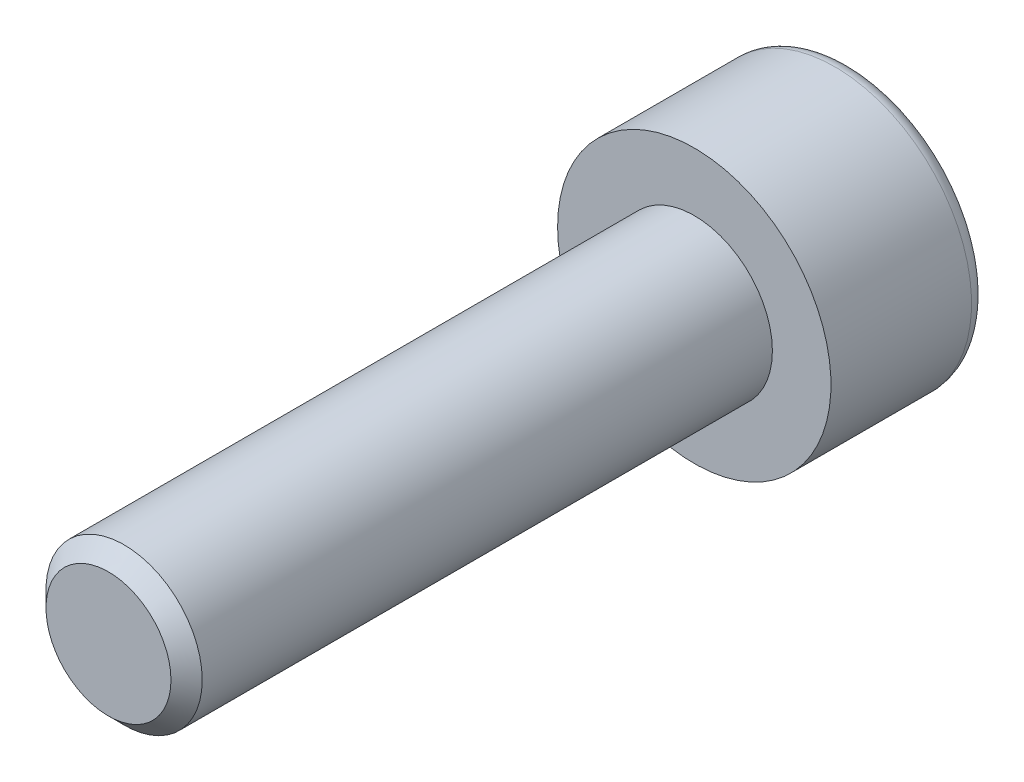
ISO-10303-21;
HEADER;
FILE_DESCRIPTION(('STEP AP214'),'2;1');
FILE_NAME('part.step','',(''),(''),'','','');
FILE_SCHEMA(('AUTOMOTIVE_DESIGN { 1 0 10303 214 1 1 1 1 }'));
ENDSEC;
DATA;
#1=APPLICATION_CONTEXT('core data for automotive mechanical design processes');
#2=APPLICATION_PROTOCOL_DEFINITION('international standard','automotive_design',2000,#1);
#3=PRODUCT_CONTEXT('',#1,'mechanical');
#4=PRODUCT('Part','Part','',(#3));
#5=PRODUCT_RELATED_PRODUCT_CATEGORY('part','',(#4));
#6=PRODUCT_DEFINITION_FORMATION('','',#4);
#7=PRODUCT_DEFINITION_CONTEXT('part definition',#1,'design');
#8=PRODUCT_DEFINITION('design','',#6,#7);
#9=PRODUCT_DEFINITION_SHAPE('','',#8);
#10=(LENGTH_UNIT() NAMED_UNIT(*) SI_UNIT(.MILLI.,.METRE.));
#11=(NAMED_UNIT(*) PLANE_ANGLE_UNIT() SI_UNIT($,.RADIAN.));
#12=(NAMED_UNIT(*) SI_UNIT($,.STERADIAN.) SOLID_ANGLE_UNIT());
#13=UNCERTAINTY_MEASURE_WITH_UNIT(LENGTH_MEASURE(1.E-05),#10,'distance_accuracy_value','');
#14=(GEOMETRIC_REPRESENTATION_CONTEXT(3) GLOBAL_UNCERTAINTY_ASSIGNED_CONTEXT((#13)) GLOBAL_UNIT_ASSIGNED_CONTEXT((#10,
#11,#12)) REPRESENTATION_CONTEXT('',''));
#15=CARTESIAN_POINT('',(0.,0.,0.));
#16=DIRECTION('',(0.,0.,1.));
#17=DIRECTION('',(1.,0.,0.));
#18=AXIS2_PLACEMENT_3D('',#15,#16,#17);
#19=CARTESIAN_POINT('',(0.,0.,-4.));
#20=DIRECTION('',(0.,0.,1.));
#21=DIRECTION('',(1.,0.,0.));
#22=AXIS2_PLACEMENT_3D('',#19,#20,#21);
#23=PLANE('',#22);
#24=CARTESIAN_POINT('',(0.,0.,-4.));
#25=DIRECTION('',(0.,0.,-1.));
#26=DIRECTION('',(-1.,0.,0.));
#27=AXIS2_PLACEMENT_3D('',#24,#25,#26);
#28=CIRCLE('',#27,3.1);
#29=CARTESIAN_POINT('',(-3.1,0.,-4.));
#30=VERTEX_POINT('',#29);
#31=EDGE_CURVE('E458',#30,#30,#28,.T.);
#32=ORIENTED_EDGE('',*,*,#31,.T.);
#33=EDGE_LOOP('',(#32));
#34=FACE_BOUND('',#33,.T.);
#35=DIRECTION('',(-0.86602540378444,0.499999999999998,0.));
#36=VECTOR('',#35,1.);
#37=CARTESIAN_POINT('',(0.,1.73205080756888,-4.));
#38=LINE('',#37,#36);
#39=CARTESIAN_POINT('',(1.5,0.866025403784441,-4.));
#40=VERTEX_POINT('',#39);
#41=CARTESIAN_POINT('',(0.,1.73205080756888,-4.));
#42=VERTEX_POINT('',#41);
#43=EDGE_CURVE('E362',#40,#42,#38,.T.);
#44=ORIENTED_EDGE('',*,*,#43,.T.);
#45=DIRECTION('',(-0.866025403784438,-0.500000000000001,0.));
#46=VECTOR('',#45,1.);
#47=CARTESIAN_POINT('',(0.,1.73205080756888,-4.));
#48=LINE('',#47,#46);
#49=CARTESIAN_POINT('',(-1.5,0.866025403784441,-4.));
#50=VERTEX_POINT('',#49);
#51=EDGE_CURVE('E402',#42,#50,#48,.T.);
#52=ORIENTED_EDGE('',*,*,#51,.T.);
#53=DIRECTION('',(0.,-1.,0.));
#54=VECTOR('',#53,1.);
#55=CARTESIAN_POINT('',(-1.5,-0.866025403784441,-4.));
#56=LINE('',#55,#54);
#57=CARTESIAN_POINT('',(-1.5,-0.866025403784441,-4.));
#58=VERTEX_POINT('',#57);
#59=EDGE_CURVE('E410',#50,#58,#56,.T.);
#60=ORIENTED_EDGE('',*,*,#59,.T.);
#61=DIRECTION('',(0.866025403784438,-0.500000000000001,0.));
#62=VECTOR('',#61,1.);
#63=CARTESIAN_POINT('',(0.,-1.73205080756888,-4.));
#64=LINE('',#63,#62);
#65=CARTESIAN_POINT('',(0.,-1.73205080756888,-4.));
#66=VERTEX_POINT('',#65);
#67=EDGE_CURVE('E428',#58,#66,#64,.T.);
#68=ORIENTED_EDGE('',*,*,#67,.T.);
#69=DIRECTION('',(0.86602540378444,0.499999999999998,0.));
#70=VECTOR('',#69,1.);
#71=CARTESIAN_POINT('',(0.,-1.73205080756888,-4.));
#72=LINE('',#71,#70);
#73=CARTESIAN_POINT('',(1.5,-0.866025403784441,-4.));
#74=VERTEX_POINT('',#73);
#75=EDGE_CURVE('E431',#66,#74,#72,.T.);
#76=ORIENTED_EDGE('',*,*,#75,.T.);
#77=DIRECTION('',(0.,1.,0.));
#78=VECTOR('',#77,1.);
#79=CARTESIAN_POINT('',(1.5,-0.866025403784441,-4.));
#80=LINE('',#79,#78);
#81=EDGE_CURVE('E421',#74,#40,#80,.T.);
#82=ORIENTED_EDGE('',*,*,#81,.T.);
#83=EDGE_LOOP('',(#44,#52,#60,#68,#76,#82));
#84=FACE_BOUND('',#83,.T.);
#85=ADVANCED_FACE('F348',(#34,#84),#23,.F.);
#86=CARTESIAN_POINT('',(0.,0.,-3.6));
#87=DIRECTION('',(0.,0.,-1.));
#88=DIRECTION('',(-1.,0.,0.));
#89=AXIS2_PLACEMENT_3D('',#86,#87,#88);
#90=TOROIDAL_SURFACE('',#89,3.1,0.4);
#91=ORIENTED_EDGE('',*,*,#31,.F.);
#92=EDGE_LOOP('',(#91));
#93=FACE_BOUND('',#92,.T.);
#94=CARTESIAN_POINT('',(0.,0.,-3.6));
#95=DIRECTION('',(0.,0.,-1.));
#96=DIRECTION('',(-1.,0.,0.));
#97=AXIS2_PLACEMENT_3D('',#94,#95,#96);
#98=CIRCLE('',#97,3.5);
#99=CARTESIAN_POINT('',(-3.5,0.,-3.6));
#100=VERTEX_POINT('',#99);
#101=EDGE_CURVE('E455',#100,#100,#98,.T.);
#102=ORIENTED_EDGE('',*,*,#101,.T.);
#103=EDGE_LOOP('',(#102));
#104=FACE_BOUND('',#103,.T.);
#105=ADVANCED_FACE('F477',(#93,#104),#90,.T.);
#106=CARTESIAN_POINT('',(0.,0.,0.));
#107=DIRECTION('',(0.,0.,-1.));
#108=DIRECTION('',(-1.,0.,0.));
#109=AXIS2_PLACEMENT_3D('',#106,#107,#108);
#110=CYLINDRICAL_SURFACE('',#109,3.5);
#111=ORIENTED_EDGE('',*,*,#101,.F.);
#112=EDGE_LOOP('',(#111));
#113=FACE_BOUND('',#112,.T.);
#114=CARTESIAN_POINT('',(0.,0.,0.));
#115=DIRECTION('',(0.,0.,-1.));
#116=DIRECTION('',(-1.,0.,0.));
#117=AXIS2_PLACEMENT_3D('',#114,#115,#116);
#118=CIRCLE('',#117,3.5);
#119=CARTESIAN_POINT('',(-3.5,0.,0.));
#120=VERTEX_POINT('',#119);
#121=EDGE_CURVE('E416',#120,#120,#118,.T.);
#122=ORIENTED_EDGE('',*,*,#121,.T.);
#123=EDGE_LOOP('',(#122));
#124=FACE_BOUND('',#123,.T.);
#125=ADVANCED_FACE('F482',(#113,#124),#110,.T.);
#126=CARTESIAN_POINT('',(0.,0.,0.));
#127=DIRECTION('',(0.,0.,-1.));
#128=DIRECTION('',(-1.,0.,0.));
#129=AXIS2_PLACEMENT_3D('',#126,#127,#128);
#130=PLANE('',#129);
#131=CARTESIAN_POINT('',(0.,0.,0.));
#132=DIRECTION('',(0.,0.,1.));
#133=DIRECTION('',(1.,0.,0.));
#134=AXIS2_PLACEMENT_3D('',#131,#132,#133);
#135=CIRCLE('',#134,2.);
#136=CARTESIAN_POINT('',(2.,0.,0.));
#137=VERTEX_POINT('',#136);
#138=EDGE_CURVE('E422',#137,#137,#135,.T.);
#139=ORIENTED_EDGE('',*,*,#138,.F.);
#140=EDGE_LOOP('',(#139));
#141=FACE_BOUND('',#140,.T.);
#142=ORIENTED_EDGE('',*,*,#121,.F.);
#143=EDGE_LOOP('',(#142));
#144=FACE_BOUND('',#143,.T.);
#145=ADVANCED_FACE('F490',(#141,#144),#130,.F.);
#146=CARTESIAN_POINT('',(0.,1.73205080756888,-2.));
#147=DIRECTION('',(-0.499999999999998,-0.86602540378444,0.));
#148=DIRECTION('',(0.86602540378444,-0.499999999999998,0.));
#149=AXIS2_PLACEMENT_3D('',#146,#147,#148);
#150=PLANE('',#149);
#151=ORIENTED_EDGE('',*,*,#43,.F.);
#152=DIRECTION('',(0.,0.,-1.));
#153=VECTOR('',#152,1.);
#154=CARTESIAN_POINT('',(1.5,0.866025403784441,-2.));
#155=LINE('',#154,#153);
#156=CARTESIAN_POINT('',(1.5,0.866025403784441,-2.));
#157=VERTEX_POINT('',#156);
#158=EDGE_CURVE('E444',#157,#40,#155,.T.);
#159=ORIENTED_EDGE('',*,*,#158,.F.);
#160=DIRECTION('',(-0.86602540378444,0.499999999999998,0.));
#161=VECTOR('',#160,1.);
#162=CARTESIAN_POINT('',(0.,1.73205080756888,-2.));
#163=LINE('',#162,#161);
#164=CARTESIAN_POINT('',(0.,1.73205080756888,-2.));
#165=VERTEX_POINT('',#164);
#166=EDGE_CURVE('E415',#157,#165,#163,.T.);
#167=ORIENTED_EDGE('',*,*,#166,.T.);
#168=DIRECTION('',(0.,0.,-1.));
#169=VECTOR('',#168,1.);
#170=CARTESIAN_POINT('',(0.,1.73205080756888,-2.));
#171=LINE('',#170,#169);
#172=EDGE_CURVE('E404',#165,#42,#171,.T.);
#173=ORIENTED_EDGE('',*,*,#172,.T.);
#174=EDGE_LOOP('',(#151,#159,#167,#173));
#175=FACE_BOUND('',#174,.T.);
#176=ADVANCED_FACE('F413',(#175),#150,.T.);
#177=CARTESIAN_POINT('',(0.,1.73205080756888,-2.));
#178=DIRECTION('',(0.500000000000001,-0.866025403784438,0.));
#179=DIRECTION('',(0.866025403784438,0.500000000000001,0.));
#180=AXIS2_PLACEMENT_3D('',#177,#178,#179);
#181=PLANE('',#180);
#182=ORIENTED_EDGE('',*,*,#51,.F.);
#183=ORIENTED_EDGE('',*,*,#172,.F.);
#184=DIRECTION('',(-0.866025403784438,-0.500000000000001,0.));
#185=VECTOR('',#184,1.);
#186=CARTESIAN_POINT('',(0.,1.73205080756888,-2.));
#187=LINE('',#186,#185);
#188=CARTESIAN_POINT('',(-1.5,0.866025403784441,-2.));
#189=VERTEX_POINT('',#188);
#190=EDGE_CURVE('E435',#165,#189,#187,.T.);
#191=ORIENTED_EDGE('',*,*,#190,.T.);
#192=DIRECTION('',(0.,0.,-1.));
#193=VECTOR('',#192,1.);
#194=CARTESIAN_POINT('',(-1.5,0.866025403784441,-2.));
#195=LINE('',#194,#193);
#196=EDGE_CURVE('E406',#189,#50,#195,.T.);
#197=ORIENTED_EDGE('',*,*,#196,.T.);
#198=EDGE_LOOP('',(#182,#183,#191,#197));
#199=FACE_BOUND('',#198,.T.);
#200=ADVANCED_FACE('F403',(#199),#181,.T.);
#201=CARTESIAN_POINT('',(-1.5,-0.866025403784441,-2.));
#202=DIRECTION('',(1.,0.,0.));
#203=DIRECTION('',(0.,0.,-1.));
#204=AXIS2_PLACEMENT_3D('',#201,#202,#203);
#205=PLANE('',#204);
#206=ORIENTED_EDGE('',*,*,#59,.F.);
#207=ORIENTED_EDGE('',*,*,#196,.F.);
#208=DIRECTION('',(0.,-1.,0.));
#209=VECTOR('',#208,1.);
#210=CARTESIAN_POINT('',(-1.5,-0.866025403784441,-2.));
#211=LINE('',#210,#209);
#212=CARTESIAN_POINT('',(-1.5,-0.866025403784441,-2.));
#213=VERTEX_POINT('',#212);
#214=EDGE_CURVE('E437',#189,#213,#211,.T.);
#215=ORIENTED_EDGE('',*,*,#214,.T.);
#216=DIRECTION('',(0.,0.,-1.));
#217=VECTOR('',#216,1.);
#218=CARTESIAN_POINT('',(-1.5,-0.866025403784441,-2.));
#219=LINE('',#218,#217);
#220=EDGE_CURVE('E450',#213,#58,#219,.T.);
#221=ORIENTED_EDGE('',*,*,#220,.T.);
#222=EDGE_LOOP('',(#206,#207,#215,#221));
#223=FACE_BOUND('',#222,.T.);
#224=ADVANCED_FACE('F505',(#223),#205,.T.);
#225=CARTESIAN_POINT('',(0.,-1.73205080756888,-2.));
#226=DIRECTION('',(0.500000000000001,0.866025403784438,0.));
#227=DIRECTION('',(-0.866025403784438,0.500000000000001,0.));
#228=AXIS2_PLACEMENT_3D('',#225,#226,#227);
#229=PLANE('',#228);
#230=ORIENTED_EDGE('',*,*,#67,.F.);
#231=ORIENTED_EDGE('',*,*,#220,.F.);
#232=DIRECTION('',(0.866025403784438,-0.500000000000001,0.));
#233=VECTOR('',#232,1.);
#234=CARTESIAN_POINT('',(0.,-1.73205080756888,-2.));
#235=LINE('',#234,#233);
#236=CARTESIAN_POINT('',(0.,-1.73205080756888,-2.));
#237=VERTEX_POINT('',#236);
#238=EDGE_CURVE('E439',#213,#237,#235,.T.);
#239=ORIENTED_EDGE('',*,*,#238,.T.);
#240=DIRECTION('',(0.,0.,-1.));
#241=VECTOR('',#240,1.);
#242=CARTESIAN_POINT('',(0.,-1.73205080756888,-2.));
#243=LINE('',#242,#241);
#244=EDGE_CURVE('E448',#237,#66,#243,.T.);
#245=ORIENTED_EDGE('',*,*,#244,.T.);
#246=EDGE_LOOP('',(#230,#231,#239,#245));
#247=FACE_BOUND('',#246,.T.);
#248=ADVANCED_FACE('F508',(#247),#229,.T.);
#249=CARTESIAN_POINT('',(0.,-1.73205080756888,-2.));
#250=DIRECTION('',(-0.499999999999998,0.86602540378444,0.));
#251=DIRECTION('',(-0.86602540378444,-0.499999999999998,0.));
#252=AXIS2_PLACEMENT_3D('',#249,#250,#251);
#253=PLANE('',#252);
#254=ORIENTED_EDGE('',*,*,#75,.F.);
#255=ORIENTED_EDGE('',*,*,#244,.F.);
#256=DIRECTION('',(0.86602540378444,0.499999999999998,0.));
#257=VECTOR('',#256,1.);
#258=CARTESIAN_POINT('',(0.,-1.73205080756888,-2.));
#259=LINE('',#258,#257);
#260=CARTESIAN_POINT('',(1.5,-0.866025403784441,-2.));
#261=VERTEX_POINT('',#260);
#262=EDGE_CURVE('E441',#237,#261,#259,.T.);
#263=ORIENTED_EDGE('',*,*,#262,.T.);
#264=DIRECTION('',(0.,0.,-1.));
#265=VECTOR('',#264,1.);
#266=CARTESIAN_POINT('',(1.5,-0.866025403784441,-2.));
#267=LINE('',#266,#265);
#268=EDGE_CURVE('E446',#261,#74,#267,.T.);
#269=ORIENTED_EDGE('',*,*,#268,.T.);
#270=EDGE_LOOP('',(#254,#255,#263,#269));
#271=FACE_BOUND('',#270,.T.);
#272=ADVANCED_FACE('F512',(#271),#253,.T.);
#273=CARTESIAN_POINT('',(1.5,-0.866025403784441,-2.));
#274=DIRECTION('',(-1.,0.,0.));
#275=DIRECTION('',(0.,0.,1.));
#276=AXIS2_PLACEMENT_3D('',#273,#274,#275);
#277=PLANE('',#276);
#278=ORIENTED_EDGE('',*,*,#81,.F.);
#279=ORIENTED_EDGE('',*,*,#268,.F.);
#280=DIRECTION('',(0.,1.,0.));
#281=VECTOR('',#280,1.);
#282=CARTESIAN_POINT('',(1.5,-0.866025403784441,-2.));
#283=LINE('',#282,#281);
#284=EDGE_CURVE('E369',#261,#157,#283,.T.);
#285=ORIENTED_EDGE('',*,*,#284,.T.);
#286=ORIENTED_EDGE('',*,*,#158,.T.);
#287=EDGE_LOOP('',(#278,#279,#285,#286));
#288=FACE_BOUND('',#287,.T.);
#289=ADVANCED_FACE('F516',(#288),#277,.T.);
#290=CARTESIAN_POINT('',(1.5,0.866025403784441,-2.));
#291=DIRECTION('',(0.,0.,1.));
#292=DIRECTION('',(1.,0.,0.));
#293=AXIS2_PLACEMENT_3D('',#290,#291,#292);
#294=PLANE('',#293);
#295=ORIENTED_EDGE('',*,*,#166,.F.);
#296=ORIENTED_EDGE('',*,*,#284,.F.);
#297=ORIENTED_EDGE('',*,*,#262,.F.);
#298=ORIENTED_EDGE('',*,*,#238,.F.);
#299=ORIENTED_EDGE('',*,*,#214,.F.);
#300=ORIENTED_EDGE('',*,*,#190,.F.);
#301=EDGE_LOOP('',(#295,#296,#297,#298,#299,#300));
#302=FACE_BOUND('',#301,.T.);
#303=ADVANCED_FACE('F520',(#302),#294,.F.);
#304=CARTESIAN_POINT('',(0.,0.,15.));
#305=DIRECTION('',(0.,0.,1.));
#306=DIRECTION('',(1.,0.,0.));
#307=AXIS2_PLACEMENT_3D('',#304,#305,#306);
#308=PLANE('',#307);
#309=CARTESIAN_POINT('',(0.,0.,15.));
#310=DIRECTION('',(0.,0.,1.));
#311=DIRECTION('',(1.,0.,0.));
#312=AXIS2_PLACEMENT_3D('',#309,#310,#311);
#313=CIRCLE('',#312,1.6);
#314=CARTESIAN_POINT('',(1.6,0.,15.));
#315=VERTEX_POINT('',#314);
#316=EDGE_CURVE('E355',#315,#315,#313,.T.);
#317=ORIENTED_EDGE('',*,*,#316,.T.);
#318=EDGE_LOOP('',(#317));
#319=FACE_BOUND('',#318,.T.);
#320=ADVANCED_FACE('F463',(#319),#308,.T.);
#321=CARTESIAN_POINT('',(0.,0.,0.));
#322=DIRECTION('',(0.,0.,1.));
#323=DIRECTION('',(1.,0.,0.));
#324=AXIS2_PLACEMENT_3D('',#321,#322,#323);
#325=CYLINDRICAL_SURFACE('',#324,2.);
#326=CARTESIAN_POINT('',(0.,0.,14.6));
#327=DIRECTION('',(0.,0.,1.));
#328=DIRECTION('',(1.,0.,0.));
#329=AXIS2_PLACEMENT_3D('',#326,#327,#328);
#330=CIRCLE('',#329,2.);
#331=CARTESIAN_POINT('',(2.,0.,14.6));
#332=VERTEX_POINT('',#331);
#333=EDGE_CURVE('E11',#332,#332,#330,.F.);
#334=ORIENTED_EDGE('',*,*,#333,.T.);
#335=EDGE_LOOP('',(#334));
#336=FACE_BOUND('',#335,.T.);
#337=ORIENTED_EDGE('',*,*,#138,.T.);
#338=EDGE_LOOP('',(#337));
#339=FACE_BOUND('',#338,.T.);
#340=ADVANCED_FACE('F467',(#336,#339),#325,.T.);
#341=CARTESIAN_POINT('',(0.,0.,15.));
#342=DIRECTION('',(0.,0.,-1.));
#343=DIRECTION('',(-1.,0.,0.));
#344=AXIS2_PLACEMENT_3D('',#341,#342,#343);
#345=CONICAL_SURFACE('',#344,1.6,0.785398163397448);
#346=ORIENTED_EDGE('',*,*,#333,.F.);
#347=EDGE_LOOP('',(#346));
#348=FACE_BOUND('',#347,.T.);
#349=ORIENTED_EDGE('',*,*,#316,.F.);
#350=EDGE_LOOP('',(#349));
#351=FACE_BOUND('',#350,.T.);
#352=ADVANCED_FACE('F465',(#348,#351),#345,.T.);
#353=CLOSED_SHELL('',(#85,#105,#125,#145,#176,#200,#224,#248,#272,#289,#303,#320,#340,#352));
#354=MANIFOLD_SOLID_BREP('B2',#353);
#355=ADVANCED_BREP_SHAPE_REPRESENTATION('',(#18,#354),#14);
#356=SHAPE_DEFINITION_REPRESENTATION(#9,#355);
ENDSEC;
END-ISO-10303-21;
